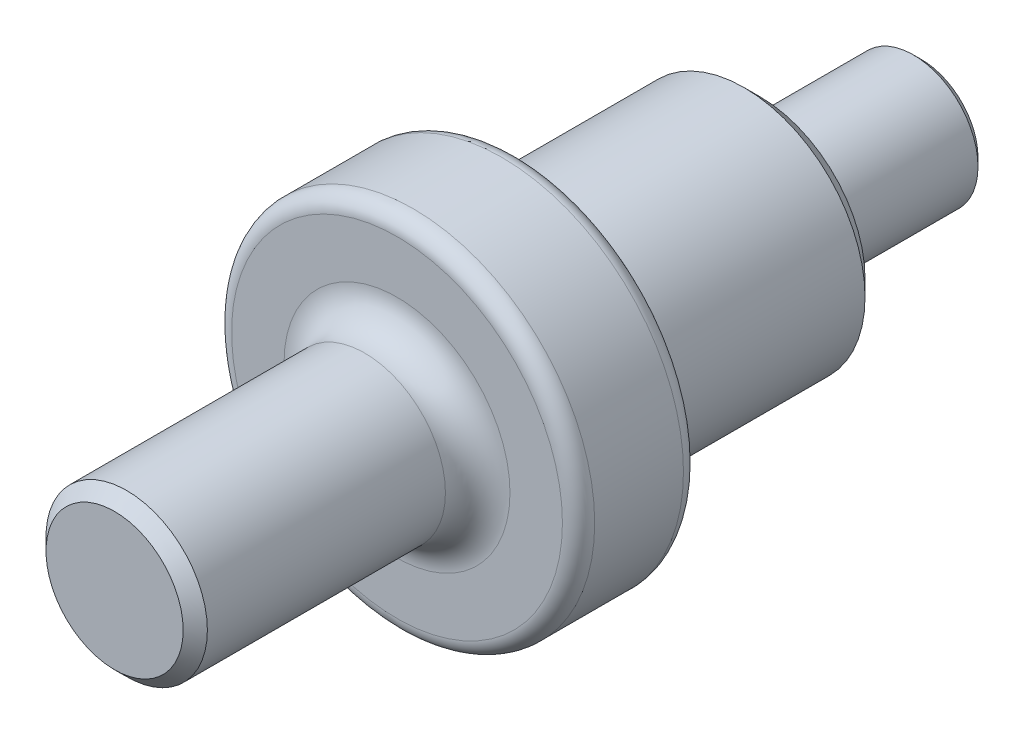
from build123d import *

# Parameters (mm, degrees)
ESBO_O1_R                = 8
RESSALTO_EXTRUS_O1_DEPTH = 20
ESBO_O2_R                = 15
RESSALTO_EXTRUS_O2_DEPTH = 30
ESBO_O3_R                = 22.5
RESSALTO_EXTRUS_O3_DEPTH = 15
ESBO_O4_R                = 10
RESSALTO_EXTRUS_O4_DEPTH = 35
CHANFRO1_SIZE            = 1
CHANFRO2_SIZE            = 2
CHANFRO3_SIZE            = 1.5
FILETE1_R                = 2
FILETE2_R                = 2
FILETE3_R                = 4


with BuildPart() as part:
    # Esbo_o1 → Ressalto-extrus_o1 (new body)
    with BuildSketch(Plane.XY):
        Circle(ESBO_O1_R)
    extrude(amount=RESSALTO_EXTRUS_O1_DEPTH)

    # Esbo_o2 → Ressalto-extrus_o2 (add)
    with BuildSketch(Plane.XY.offset(20)):
        Circle(ESBO_O2_R)
    extrude(amount=RESSALTO_EXTRUS_O2_DEPTH)

    # Esbo_o3 → Ressalto-extrus_o3 (add)
    with BuildSketch(Plane.XY.offset(50)):
        Circle(ESBO_O3_R)
    extrude(amount=RESSALTO_EXTRUS_O3_DEPTH)

    # Esbo_o4 → Ressalto-extrus_o4 (add)
    with BuildSketch(Plane.XY.offset(65)):
        Circle(ESBO_O4_R)
    extrude(amount=RESSALTO_EXTRUS_O4_DEPTH)

    # Chanfro1
    chanfro1_edges = [part.edges().sort_by_distance(p)[0] for p in [
        (-8, 0, 0),
    ]]
    chamfer(chanfro1_edges, length=CHANFRO1_SIZE)

    # Chanfro2
    chanfro2_edges = [part.edges().sort_by_distance(p)[0] for p in [
        (-15, 0, 20),
    ]]
    chamfer(chanfro2_edges, length=CHANFRO2_SIZE)

    # Chanfro3
    chanfro3_edges = [part.edges().sort_by_distance(p)[0] for p in [
        (-10, 0, 100),
    ]]
    chamfer(chanfro3_edges, length=CHANFRO3_SIZE)

    # Filete1
    filete1_edges = [part.edges().sort_by_distance(p)[0] for p in [
        (-22.5, 0, 50),
    ]]
    fillet(filete1_edges, radius=FILETE1_R)

    # Filete2
    filete2_edges = [part.edges().sort_by_distance(p)[0] for p in [
        (-22.5, 0, 65),
    ]]
    fillet(filete2_edges, radius=FILETE2_R)

    # Filete3
    filete3_edges = [part.edges().sort_by_distance(p)[0] for p in [
        (-10, 0, 65),
    ]]
    fillet(filete3_edges, radius=FILETE3_R)


solid = part.part
